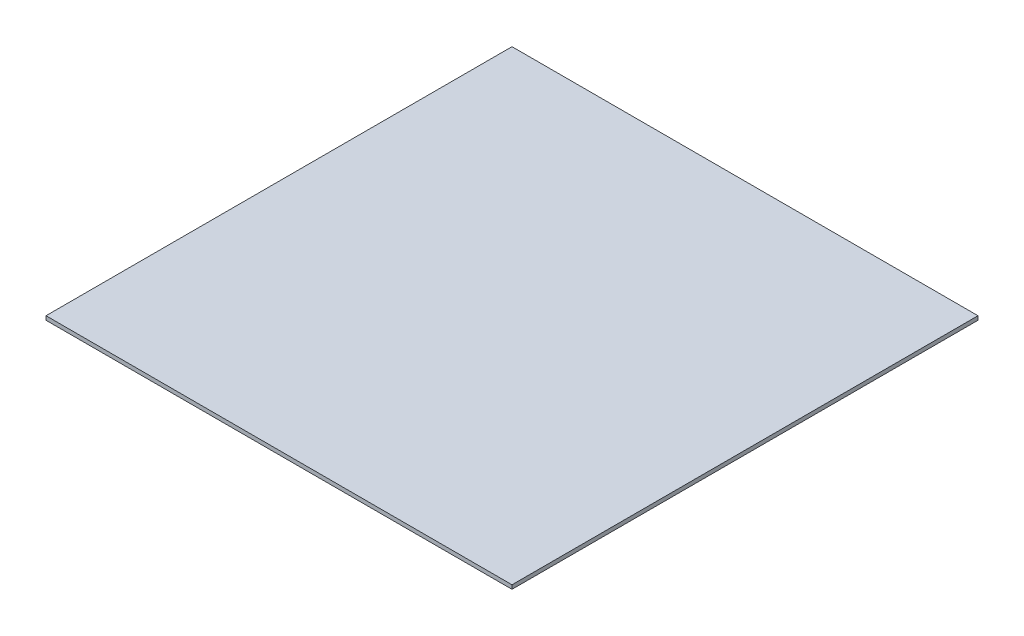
ISO-10303-21;
HEADER;
FILE_DESCRIPTION(('STEP AP214'),'2;1');
FILE_NAME('part.step','',(''),(''),'','','');
FILE_SCHEMA(('AUTOMOTIVE_DESIGN { 1 0 10303 214 1 1 1 1 }'));
ENDSEC;
DATA;
#1=APPLICATION_CONTEXT('core data for automotive mechanical design processes');
#2=APPLICATION_PROTOCOL_DEFINITION('international standard','automotive_design',2000,#1);
#3=PRODUCT_CONTEXT('',#1,'mechanical');
#4=PRODUCT('Part','Part','',(#3));
#5=PRODUCT_RELATED_PRODUCT_CATEGORY('part','',(#4));
#6=PRODUCT_DEFINITION_FORMATION('','',#4);
#7=PRODUCT_DEFINITION_CONTEXT('part definition',#1,'design');
#8=PRODUCT_DEFINITION('design','',#6,#7);
#9=PRODUCT_DEFINITION_SHAPE('','',#8);
#10=(LENGTH_UNIT() NAMED_UNIT(*) SI_UNIT(.MILLI.,.METRE.));
#11=(NAMED_UNIT(*) PLANE_ANGLE_UNIT() SI_UNIT($,.RADIAN.));
#12=(NAMED_UNIT(*) SI_UNIT($,.STERADIAN.) SOLID_ANGLE_UNIT());
#13=UNCERTAINTY_MEASURE_WITH_UNIT(LENGTH_MEASURE(1.E-05),#10,'distance_accuracy_value','');
#14=(GEOMETRIC_REPRESENTATION_CONTEXT(3) GLOBAL_UNCERTAINTY_ASSIGNED_CONTEXT((#13)) GLOBAL_UNIT_ASSIGNED_CONTEXT((#10,
#11,#12)) REPRESENTATION_CONTEXT('',''));
#15=CARTESIAN_POINT('',(0.,0.,0.));
#16=DIRECTION('',(0.,0.,1.));
#17=DIRECTION('',(1.,0.,0.));
#18=AXIS2_PLACEMENT_3D('',#15,#16,#17);
#19=CARTESIAN_POINT('',(93.472,1.5875,93.472));
#20=DIRECTION('',(-1.,0.,0.));
#21=DIRECTION('',(0.,0.,1.));
#22=AXIS2_PLACEMENT_3D('',#19,#20,#21);
#23=PLANE('',#22);
#24=DIRECTION('',(0.,0.,-1.));
#25=VECTOR('',#24,1.);
#26=CARTESIAN_POINT('',(93.472,0.,93.472));
#27=LINE('',#26,#25);
#28=CARTESIAN_POINT('',(93.472,0.,93.472));
#29=VERTEX_POINT('',#28);
#30=CARTESIAN_POINT('',(93.472,0.,-93.472));
#31=VERTEX_POINT('',#30);
#32=EDGE_CURVE('E104',#29,#31,#27,.T.);
#33=ORIENTED_EDGE('',*,*,#32,.T.);
#34=DIRECTION('',(0.,-1.,0.));
#35=VECTOR('',#34,1.);
#36=CARTESIAN_POINT('',(93.472,1.5875,-93.472));
#37=LINE('',#36,#35);
#38=CARTESIAN_POINT('',(93.472,1.5875,-93.472));
#39=VERTEX_POINT('',#38);
#40=EDGE_CURVE('E11',#39,#31,#37,.T.);
#41=ORIENTED_EDGE('',*,*,#40,.F.);
#42=DIRECTION('',(0.,0.,-1.));
#43=VECTOR('',#42,1.);
#44=CARTESIAN_POINT('',(93.472,1.5875,93.472));
#45=LINE('',#44,#43);
#46=CARTESIAN_POINT('',(93.472,1.5875,93.472));
#47=VERTEX_POINT('',#46);
#48=EDGE_CURVE('E92',#47,#39,#45,.T.);
#49=ORIENTED_EDGE('',*,*,#48,.F.);
#50=DIRECTION('',(0.,-1.,0.));
#51=VECTOR('',#50,1.);
#52=CARTESIAN_POINT('',(93.472,1.5875,93.472));
#53=LINE('',#52,#51);
#54=EDGE_CURVE('E100',#47,#29,#53,.T.);
#55=ORIENTED_EDGE('',*,*,#54,.T.);
#56=EDGE_LOOP('',(#33,#41,#49,#55));
#57=FACE_BOUND('',#56,.T.);
#58=ADVANCED_FACE('F41',(#57),#23,.F.);
#59=CARTESIAN_POINT('',(-93.472,1.5875,-93.472));
#60=DIRECTION('',(0.,0.,1.));
#61=DIRECTION('',(1.,0.,0.));
#62=AXIS2_PLACEMENT_3D('',#59,#60,#61);
#63=PLANE('',#62);
#64=DIRECTION('',(-1.,0.,0.));
#65=VECTOR('',#64,1.);
#66=CARTESIAN_POINT('',(-93.472,0.,-93.472));
#67=LINE('',#66,#65);
#68=CARTESIAN_POINT('',(-93.472,0.,-93.472));
#69=VERTEX_POINT('',#68);
#70=EDGE_CURVE('E96',#31,#69,#67,.T.);
#71=ORIENTED_EDGE('',*,*,#70,.T.);
#72=DIRECTION('',(0.,-1.,0.));
#73=VECTOR('',#72,1.);
#74=CARTESIAN_POINT('',(-93.472,1.5875,-93.472));
#75=LINE('',#74,#73);
#76=CARTESIAN_POINT('',(-93.472,1.5875,-93.472));
#77=VERTEX_POINT('',#76);
#78=EDGE_CURVE('E49',#77,#69,#75,.T.);
#79=ORIENTED_EDGE('',*,*,#78,.F.);
#80=DIRECTION('',(-1.,0.,0.));
#81=VECTOR('',#80,1.);
#82=CARTESIAN_POINT('',(-93.472,1.5875,-93.472));
#83=LINE('',#82,#81);
#84=EDGE_CURVE('E87',#39,#77,#83,.T.);
#85=ORIENTED_EDGE('',*,*,#84,.F.);
#86=ORIENTED_EDGE('',*,*,#40,.T.);
#87=EDGE_LOOP('',(#71,#79,#85,#86));
#88=FACE_BOUND('',#87,.T.);
#89=ADVANCED_FACE('F95',(#88),#63,.F.);
#90=CARTESIAN_POINT('',(-93.472,1.5875,93.472));
#91=DIRECTION('',(1.,0.,0.));
#92=DIRECTION('',(0.,0.,-1.));
#93=AXIS2_PLACEMENT_3D('',#90,#91,#92);
#94=PLANE('',#93);
#95=DIRECTION('',(0.,0.,1.));
#96=VECTOR('',#95,1.);
#97=CARTESIAN_POINT('',(-93.472,0.,93.472));
#98=LINE('',#97,#96);
#99=CARTESIAN_POINT('',(-93.472,0.,93.472));
#100=VERTEX_POINT('',#99);
#101=EDGE_CURVE('E74',#69,#100,#98,.T.);
#102=ORIENTED_EDGE('',*,*,#101,.T.);
#103=DIRECTION('',(0.,-1.,0.));
#104=VECTOR('',#103,1.);
#105=CARTESIAN_POINT('',(-93.472,1.5875,93.472));
#106=LINE('',#105,#104);
#107=CARTESIAN_POINT('',(-93.472,1.5875,93.472));
#108=VERTEX_POINT('',#107);
#109=EDGE_CURVE('E97',#108,#100,#106,.T.);
#110=ORIENTED_EDGE('',*,*,#109,.F.);
#111=DIRECTION('',(0.,0.,1.));
#112=VECTOR('',#111,1.);
#113=CARTESIAN_POINT('',(-93.472,1.5875,93.472));
#114=LINE('',#113,#112);
#115=EDGE_CURVE('E90',#77,#108,#114,.T.);
#116=ORIENTED_EDGE('',*,*,#115,.F.);
#117=ORIENTED_EDGE('',*,*,#78,.T.);
#118=EDGE_LOOP('',(#102,#110,#116,#117));
#119=FACE_BOUND('',#118,.T.);
#120=ADVANCED_FACE('F98',(#119),#94,.F.);
#121=CARTESIAN_POINT('',(-93.472,1.5875,93.472));
#122=DIRECTION('',(0.,0.,-1.));
#123=DIRECTION('',(-1.,0.,0.));
#124=AXIS2_PLACEMENT_3D('',#121,#122,#123);
#125=PLANE('',#124);
#126=DIRECTION('',(1.,0.,0.));
#127=VECTOR('',#126,1.);
#128=CARTESIAN_POINT('',(-93.472,0.,93.472));
#129=LINE('',#128,#127);
#130=EDGE_CURVE('E80',#100,#29,#129,.T.);
#131=ORIENTED_EDGE('',*,*,#130,.T.);
#132=ORIENTED_EDGE('',*,*,#54,.F.);
#133=DIRECTION('',(1.,0.,0.));
#134=VECTOR('',#133,1.);
#135=CARTESIAN_POINT('',(-93.472,1.5875,93.472));
#136=LINE('',#135,#134);
#137=EDGE_CURVE('E57',#108,#47,#136,.T.);
#138=ORIENTED_EDGE('',*,*,#137,.F.);
#139=ORIENTED_EDGE('',*,*,#109,.T.);
#140=EDGE_LOOP('',(#131,#132,#138,#139));
#141=FACE_BOUND('',#140,.T.);
#142=ADVANCED_FACE('F111',(#141),#125,.F.);
#143=CARTESIAN_POINT('',(0.,1.5875,0.));
#144=DIRECTION('',(0.,-1.,0.));
#145=DIRECTION('',(0.,0.,-1.));
#146=AXIS2_PLACEMENT_3D('',#143,#144,#145);
#147=PLANE('',#146);
#148=ORIENTED_EDGE('',*,*,#48,.T.);
#149=ORIENTED_EDGE('',*,*,#84,.T.);
#150=ORIENTED_EDGE('',*,*,#115,.T.);
#151=ORIENTED_EDGE('',*,*,#137,.T.);
#152=EDGE_LOOP('',(#148,#149,#150,#151));
#153=FACE_BOUND('',#152,.T.);
#154=ADVANCED_FACE('F88',(#153),#147,.F.);
#155=CARTESIAN_POINT('',(0.,0.,0.));
#156=DIRECTION('',(0.,-1.,0.));
#157=DIRECTION('',(0.,0.,-1.));
#158=AXIS2_PLACEMENT_3D('',#155,#156,#157);
#159=PLANE('',#158);
#160=ORIENTED_EDGE('',*,*,#32,.F.);
#161=ORIENTED_EDGE('',*,*,#130,.F.);
#162=ORIENTED_EDGE('',*,*,#101,.F.);
#163=ORIENTED_EDGE('',*,*,#70,.F.);
#164=EDGE_LOOP('',(#160,#161,#162,#163));
#165=FACE_BOUND('',#164,.T.);
#166=ADVANCED_FACE('F114',(#165),#159,.T.);
#167=CLOSED_SHELL('',(#58,#89,#120,#142,#154,#166));
#168=MANIFOLD_SOLID_BREP('B2',#167);
#169=ADVANCED_BREP_SHAPE_REPRESENTATION('',(#18,#168),#14);
#170=SHAPE_DEFINITION_REPRESENTATION(#9,#169);
ENDSEC;
END-ISO-10303-21;
